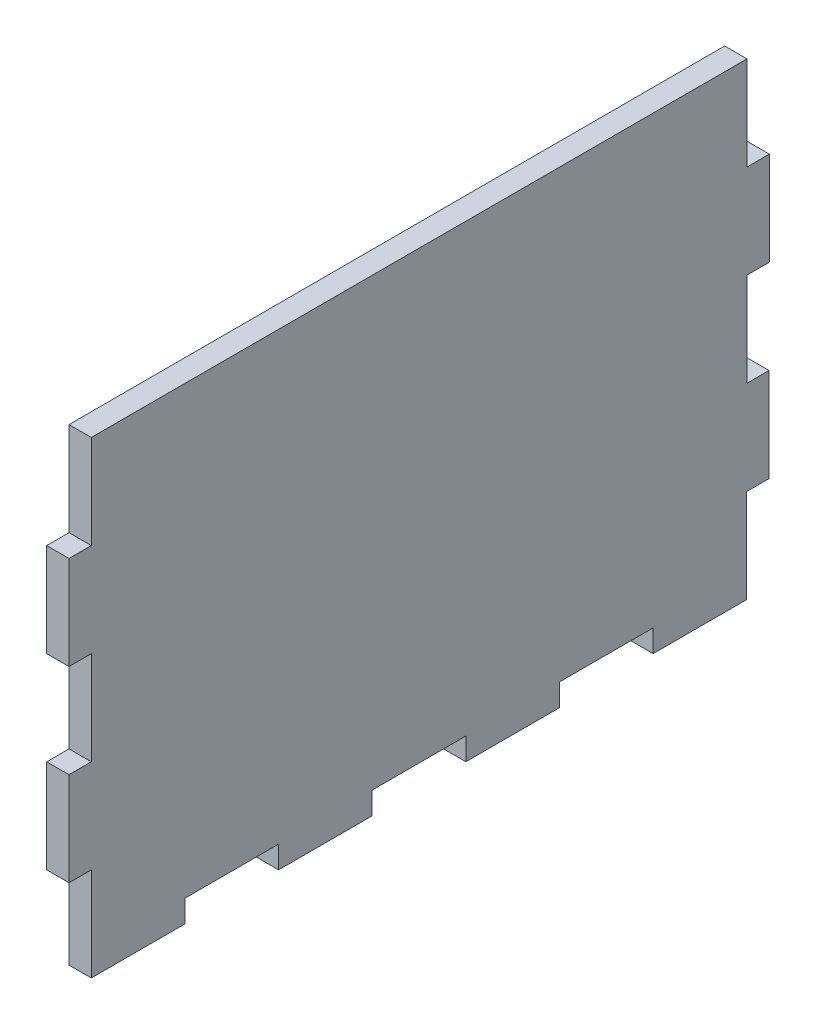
from build123d import *

# Parameters (mm, degrees)
BOSS_EXTRUDE1_DEPTH = 7.62


with BuildPart() as part:
    # Sketch2 → Boss-Extrude1 (new body)
    with BuildSketch(Plane(origin=(0, 0, 0), x_dir=(0, 0, -1), z_dir=(1, 0, 0))):
        Polygon((0, 0), (32.004, 0), (32.004, 7.62), (64.008, 7.62), (64.008, 0), (96.012, 0), (96.012, 7.62), (128.016, 7.62), (128.016, 0), (160.02, 0), (160.02, 7.62), (192.024, 7.62), (192.024, 0), (224.028, 0), (224.028, 32), (231.648, 32), (231.648, 64), (224.120706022, 64), (224.120706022, 96), (231.740706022, 96), (231.740706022, 128), (224.120706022, 128), (224.120706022, 160), (0, 160), (0, 128), (-7.62, 128), (-7.62, 96), (0, 96), (0, 64), (-7.62, 64), (-7.62, 32), (0, 32), align=None)
    extrude(amount=BOSS_EXTRUDE1_DEPTH)


solid = part.part
